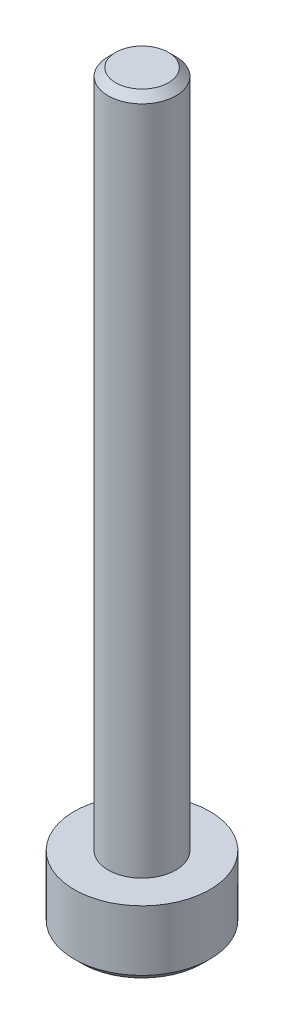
from build123d import *

# Parameters (mm, degrees)
SKETCH1_R           = 1.5
BOSS_EXTRUDE1_DEPTH = 30
SKETCH2_R           = 3
BOSS_EXTRUDE2_DEPTH = 3
CUT_EXTRUDE1_DEPTH  = 2
CHAMFER1_SIZE       = 0.333333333


with BuildPart() as part:
    # Sketch1 → Boss-Extrude1 (new body)
    with BuildSketch(Plane(origin=(0, 0, 0), x_dir=(1, 0, 0), z_dir=(0, 1, 0))):
        with Locations(Location((0, 0, 0), (0, 0, 270))):
            Circle(SKETCH1_R)
    extrude(amount=BOSS_EXTRUDE1_DEPTH)

    # Sketch2 → Boss-Extrude2 (add)
    with BuildSketch(Plane.XZ):
        with Locations(Location((0, 0, 0), (0, 0, 270))):
            Circle(SKETCH2_R)
    extrude(amount=BOSS_EXTRUDE2_DEPTH)

    # Sketch3 → Cut-Extrude1 (cut)
    with BuildSketch(Plane.XZ.offset(3)):
        Polygon((0, 1.732050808), (-1.5, 0.866025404), (-1.5, -0.866025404), (0, -1.732050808), (1.5, -0.866025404), (1.5, 0.866025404), align=None)
    extrude(amount=-CUT_EXTRUDE1_DEPTH, mode=Mode.SUBTRACT)

    # Chamfer1
    chamfer1_edges = [part.edges().sort_by_distance(p)[0] for p in [
        (0, 30, -1.5),
        (0, -3, 3),
    ]]
    chamfer(chamfer1_edges, length=CHAMFER1_SIZE)


solid = part.part
